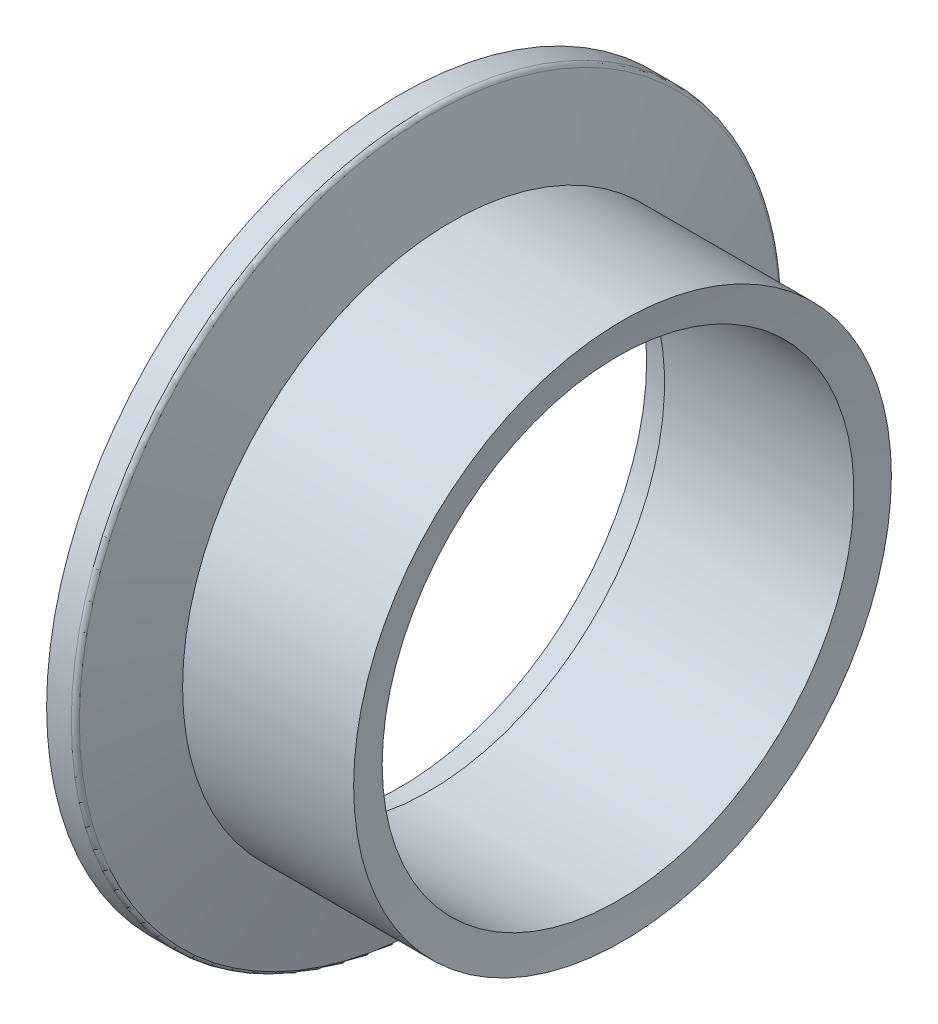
ISO-10303-21;
HEADER;
FILE_DESCRIPTION(('STEP AP214'),'2;1');
FILE_NAME('part.step','',(''),(''),'','','');
FILE_SCHEMA(('AUTOMOTIVE_DESIGN { 1 0 10303 214 1 1 1 1 }'));
ENDSEC;
DATA;
#1=APPLICATION_CONTEXT('core data for automotive mechanical design processes');
#2=APPLICATION_PROTOCOL_DEFINITION('international standard','automotive_design',2000,#1);
#3=PRODUCT_CONTEXT('',#1,'mechanical');
#4=PRODUCT('Part','Part','',(#3));
#5=PRODUCT_RELATED_PRODUCT_CATEGORY('part','',(#4));
#6=PRODUCT_DEFINITION_FORMATION('','',#4);
#7=PRODUCT_DEFINITION_CONTEXT('part definition',#1,'design');
#8=PRODUCT_DEFINITION('design','',#6,#7);
#9=PRODUCT_DEFINITION_SHAPE('','',#8);
#10=(LENGTH_UNIT() NAMED_UNIT(*) SI_UNIT(.MILLI.,.METRE.));
#11=(NAMED_UNIT(*) PLANE_ANGLE_UNIT() SI_UNIT($,.RADIAN.));
#12=(NAMED_UNIT(*) SI_UNIT($,.STERADIAN.) SOLID_ANGLE_UNIT());
#13=UNCERTAINTY_MEASURE_WITH_UNIT(LENGTH_MEASURE(1.E-05),#10,'distance_accuracy_value','');
#14=(GEOMETRIC_REPRESENTATION_CONTEXT(3) GLOBAL_UNCERTAINTY_ASSIGNED_CONTEXT((#13)) GLOBAL_UNIT_ASSIGNED_CONTEXT((#10,
#11,#12)) REPRESENTATION_CONTEXT('',''));
#15=CARTESIAN_POINT('',(0.,0.,0.));
#16=DIRECTION('',(0.,0.,1.));
#17=DIRECTION('',(1.,0.,0.));
#18=AXIS2_PLACEMENT_3D('',#15,#16,#17);
#19=CARTESIAN_POINT('',(221.499999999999,0.,2.22044604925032E-13));
#20=DIRECTION('',(0.,0.,-1.));
#21=DIRECTION('',(-1.,0.,0.));
#22=AXIS2_PLACEMENT_3D('',#19,#20,#21);
#23=SPHERICAL_SURFACE('',#22,199.999999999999);
#24=CARTESIAN_POINT('',(23.5410396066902,0.,0.));
#25=DIRECTION('',(-1.,0.,0.));
#26=DIRECTION('',(0.,0.,1.));
#27=AXIS2_PLACEMENT_3D('',#24,#25,#26);
#28=CIRCLE('',#27,28.5);
#29=CARTESIAN_POINT('',(23.5410396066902,0.,28.5));
#30=VERTEX_POINT('',#29);
#31=EDGE_CURVE('E21',#30,#30,#28,.T.);
#32=ORIENTED_EDGE('',*,*,#31,.F.);
#33=EDGE_LOOP('',(#32));
#34=FACE_BOUND('',#33,.T.);
#35=CARTESIAN_POINT('',(23.0686516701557,0.,0.));
#36=DIRECTION('',(-1.,0.,0.));
#37=DIRECTION('',(0.,0.,1.));
#38=AXIS2_PLACEMENT_3D('',#35,#36,#37);
#39=CIRCLE('',#38,25.);
#40=CARTESIAN_POINT('',(23.0686516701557,0.,25.));
#41=VERTEX_POINT('',#40);
#42=EDGE_CURVE('E42',#41,#41,#39,.T.);
#43=ORIENTED_EDGE('',*,*,#42,.T.);
#44=EDGE_LOOP('',(#43));
#45=FACE_BOUND('',#44,.T.);
#46=ADVANCED_FACE('F17',(#34,#45),#23,.F.);
#47=CARTESIAN_POINT('',(0.,0.,0.));
#48=DIRECTION('',(-1.,0.,0.));
#49=DIRECTION('',(0.,0.,1.));
#50=AXIS2_PLACEMENT_3D('',#47,#48,#49);
#51=CYLINDRICAL_SURFACE('',#50,28.5);
#52=ORIENTED_EDGE('',*,*,#31,.T.);
#53=EDGE_LOOP('',(#52));
#54=FACE_BOUND('',#53,.T.);
#55=CARTESIAN_POINT('',(5.41154273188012,0.,0.));
#56=DIRECTION('',(-1.,0.,0.));
#57=DIRECTION('',(0.,0.,1.));
#58=AXIS2_PLACEMENT_3D('',#55,#56,#57);
#59=CIRCLE('',#58,28.5);
#60=CARTESIAN_POINT('',(5.41154273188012,0.,28.5));
#61=VERTEX_POINT('',#60);
#62=EDGE_CURVE('E41',#61,#61,#59,.T.);
#63=ORIENTED_EDGE('',*,*,#62,.F.);
#64=EDGE_LOOP('',(#63));
#65=FACE_BOUND('',#64,.T.);
#66=ADVANCED_FACE('F50',(#54,#65),#51,.T.);
#67=CARTESIAN_POINT('',(0.,0.,0.));
#68=DIRECTION('',(-1.,0.,0.));
#69=DIRECTION('',(0.,0.,1.));
#70=AXIS2_PLACEMENT_3D('',#67,#68,#69);
#71=CYLINDRICAL_SURFACE('',#70,25.);
#72=CARTESIAN_POINT('',(3.,0.,0.));
#73=DIRECTION('',(-1.,0.,0.));
#74=DIRECTION('',(0.,0.,1.));
#75=AXIS2_PLACEMENT_3D('',#72,#73,#74);
#76=CIRCLE('',#75,25.);
#77=CARTESIAN_POINT('',(3.,0.,25.));
#78=VERTEX_POINT('',#77);
#79=EDGE_CURVE('E39',#78,#78,#76,.F.);
#80=ORIENTED_EDGE('',*,*,#79,.F.);
#81=EDGE_LOOP('',(#80));
#82=FACE_BOUND('',#81,.T.);
#83=ORIENTED_EDGE('',*,*,#42,.F.);
#84=EDGE_LOOP('',(#83));
#85=FACE_BOUND('',#84,.T.);
#86=ADVANCED_FACE('F58',(#82,#85),#71,.F.);
#87=CARTESIAN_POINT('',(3.09929941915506,0.,0.));
#88=DIRECTION('',(-1.,0.,0.));
#89=DIRECTION('',(0.,-1.,0.));
#90=AXIS2_PLACEMENT_3D('',#87,#88,#89);
#91=CONICAL_SURFACE('',#90,37.1294095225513,1.30899693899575);
#92=ORIENTED_EDGE('',*,*,#62,.T.);
#93=EDGE_LOOP('',(#92));
#94=FACE_BOUND('',#93,.T.);
#95=CARTESIAN_POINT('',(3.09929941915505,0.,0.));
#96=DIRECTION('',(1.,0.,0.));
#97=DIRECTION('',(0.,0.,-1.));
#98=AXIS2_PLACEMENT_3D('',#95,#96,#97);
#99=CIRCLE('',#98,37.1294095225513);
#100=CARTESIAN_POINT('',(3.09929941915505,0.,-37.1294095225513));
#101=VERTEX_POINT('',#100);
#102=EDGE_CURVE('E38',#101,#101,#99,.F.);
#103=ORIENTED_EDGE('',*,*,#102,.F.);
#104=EDGE_LOOP('',(#103));
#105=FACE_BOUND('',#104,.T.);
#106=ADVANCED_FACE('F88',(#94,#105),#91,.T.);
#107=CARTESIAN_POINT('',(3.,0.,0.));
#108=DIRECTION('',(-1.,0.,0.));
#109=DIRECTION('',(0.,0.,1.));
#110=AXIS2_PLACEMENT_3D('',#107,#108,#109);
#111=PLANE('',#110);
#112=CARTESIAN_POINT('',(3.,0.,0.));
#113=DIRECTION('',(-1.,0.,0.));
#114=DIRECTION('',(0.,0.,1.));
#115=AXIS2_PLACEMENT_3D('',#112,#113,#114);
#116=CIRCLE('',#115,26.1);
#117=CARTESIAN_POINT('',(3.,0.,26.1));
#118=VERTEX_POINT('',#117);
#119=EDGE_CURVE('E35',#118,#118,#116,.T.);
#120=ORIENTED_EDGE('',*,*,#119,.T.);
#121=EDGE_LOOP('',(#120));
#122=FACE_BOUND('',#121,.T.);
#123=ORIENTED_EDGE('',*,*,#79,.T.);
#124=EDGE_LOOP('',(#123));
#125=FACE_BOUND('',#124,.T.);
#126=ADVANCED_FACE('F78',(#122,#125),#111,.T.);
#127=CARTESIAN_POINT('',(2.61633650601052,0.,0.));
#128=DIRECTION('',(1.,0.,0.));
#129=DIRECTION('',(0.,0.,-1.));
#130=AXIS2_PLACEMENT_3D('',#127,#128,#129);
#131=TOROIDAL_SURFACE('',#130,37.,0.5);
#132=CARTESIAN_POINT('',(2.61633650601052,0.,0.));
#133=DIRECTION('',(-1.,0.,0.));
#134=DIRECTION('',(0.,0.,1.));
#135=AXIS2_PLACEMENT_3D('',#132,#133,#134);
#136=CIRCLE('',#135,37.5);
#137=CARTESIAN_POINT('',(2.61633650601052,0.,37.5));
#138=VERTEX_POINT('',#137);
#139=EDGE_CURVE('E30',#138,#138,#136,.T.);
#140=ORIENTED_EDGE('',*,*,#139,.F.);
#141=EDGE_LOOP('',(#140));
#142=FACE_BOUND('',#141,.T.);
#143=ORIENTED_EDGE('',*,*,#102,.T.);
#144=EDGE_LOOP('',(#143));
#145=FACE_BOUND('',#144,.T.);
#146=ADVANCED_FACE('F73',(#142,#145),#131,.T.);
#147=CARTESIAN_POINT('',(3.,0.,0.));
#148=DIRECTION('',(-1.,0.,0.));
#149=DIRECTION('',(0.,0.,1.));
#150=AXIS2_PLACEMENT_3D('',#147,#148,#149);
#151=CYLINDRICAL_SURFACE('',#150,26.1);
#152=CARTESIAN_POINT('',(0.,0.,0.));
#153=DIRECTION('',(-1.,0.,0.));
#154=DIRECTION('',(0.,0.,1.));
#155=AXIS2_PLACEMENT_3D('',#152,#153,#154);
#156=CIRCLE('',#155,26.1);
#157=CARTESIAN_POINT('',(0.,0.,26.1));
#158=VERTEX_POINT('',#157);
#159=EDGE_CURVE('E25',#158,#158,#156,.F.);
#160=ORIENTED_EDGE('',*,*,#159,.F.);
#161=EDGE_LOOP('',(#160));
#162=FACE_BOUND('',#161,.T.);
#163=ORIENTED_EDGE('',*,*,#119,.F.);
#164=EDGE_LOOP('',(#163));
#165=FACE_BOUND('',#164,.T.);
#166=ADVANCED_FACE('F66',(#162,#165),#151,.F.);
#167=CARTESIAN_POINT('',(0.,0.,0.));
#168=DIRECTION('',(-1.,0.,0.));
#169=DIRECTION('',(0.,0.,1.));
#170=AXIS2_PLACEMENT_3D('',#167,#168,#169);
#171=CYLINDRICAL_SURFACE('',#170,37.5);
#172=ORIENTED_EDGE('',*,*,#139,.T.);
#173=EDGE_LOOP('',(#172));
#174=FACE_BOUND('',#173,.T.);
#175=CARTESIAN_POINT('',(0.,0.,0.));
#176=DIRECTION('',(-1.,0.,0.));
#177=DIRECTION('',(0.,0.,1.));
#178=AXIS2_PLACEMENT_3D('',#175,#176,#177);
#179=CIRCLE('',#178,37.5);
#180=CARTESIAN_POINT('',(0.,0.,37.5));
#181=VERTEX_POINT('',#180);
#182=EDGE_CURVE('E10',#181,#181,#179,.T.);
#183=ORIENTED_EDGE('',*,*,#182,.F.);
#184=EDGE_LOOP('',(#183));
#185=FACE_BOUND('',#184,.T.);
#186=ADVANCED_FACE('F61',(#174,#185),#171,.T.);
#187=CARTESIAN_POINT('',(0.,25.,0.));
#188=DIRECTION('',(-1.,0.,0.));
#189=DIRECTION('',(0.,0.,1.));
#190=AXIS2_PLACEMENT_3D('',#187,#188,#189);
#191=PLANE('',#190);
#192=ORIENTED_EDGE('',*,*,#182,.T.);
#193=EDGE_LOOP('',(#192));
#194=FACE_BOUND('',#193,.T.);
#195=ORIENTED_EDGE('',*,*,#159,.T.);
#196=EDGE_LOOP('',(#195));
#197=FACE_BOUND('',#196,.T.);
#198=ADVANCED_FACE('F59',(#194,#197),#191,.T.);
#199=CLOSED_SHELL('',(#46,#66,#86,#106,#126,#146,#166,#186,#198));
#200=MANIFOLD_SOLID_BREP('B1',#199);
#201=ADVANCED_BREP_SHAPE_REPRESENTATION('',(#18,#200),#14);
#202=SHAPE_DEFINITION_REPRESENTATION(#9,#201);
ENDSEC;
END-ISO-10303-21;
